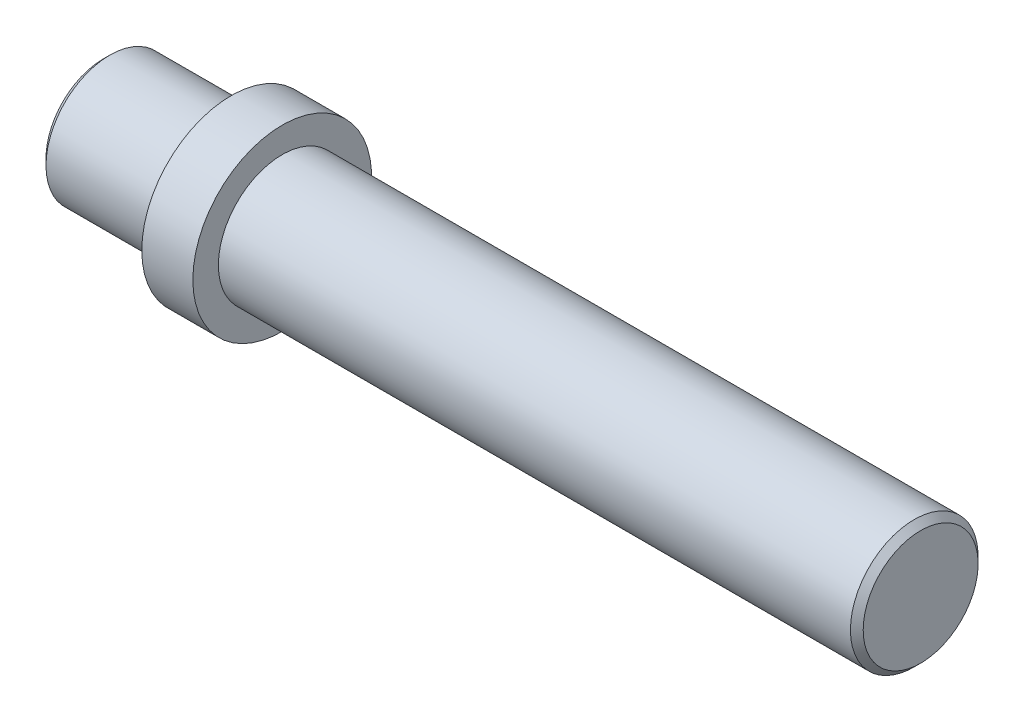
ISO-10303-21;
HEADER;
FILE_DESCRIPTION(('STEP AP214'),'2;1');
FILE_NAME('part.step','',(''),(''),'','','');
FILE_SCHEMA(('AUTOMOTIVE_DESIGN { 1 0 10303 214 1 1 1 1 }'));
ENDSEC;
DATA;
#1=APPLICATION_CONTEXT('core data for automotive mechanical design processes');
#2=APPLICATION_PROTOCOL_DEFINITION('international standard','automotive_design',2000,#1);
#3=PRODUCT_CONTEXT('',#1,'mechanical');
#4=PRODUCT('Part','Part','',(#3));
#5=PRODUCT_RELATED_PRODUCT_CATEGORY('part','',(#4));
#6=PRODUCT_DEFINITION_FORMATION('','',#4);
#7=PRODUCT_DEFINITION_CONTEXT('part definition',#1,'design');
#8=PRODUCT_DEFINITION('design','',#6,#7);
#9=PRODUCT_DEFINITION_SHAPE('','',#8);
#10=(LENGTH_UNIT() NAMED_UNIT(*) SI_UNIT(.MILLI.,.METRE.));
#11=(NAMED_UNIT(*) PLANE_ANGLE_UNIT() SI_UNIT($,.RADIAN.));
#12=(NAMED_UNIT(*) SI_UNIT($,.STERADIAN.) SOLID_ANGLE_UNIT());
#13=UNCERTAINTY_MEASURE_WITH_UNIT(LENGTH_MEASURE(1.E-05),#10,'distance_accuracy_value','');
#14=(GEOMETRIC_REPRESENTATION_CONTEXT(3) GLOBAL_UNCERTAINTY_ASSIGNED_CONTEXT((#13)) GLOBAL_UNIT_ASSIGNED_CONTEXT((#10,
#11,#12)) REPRESENTATION_CONTEXT('',''));
#15=CARTESIAN_POINT('',(0.,0.,0.));
#16=DIRECTION('',(0.,0.,1.));
#17=DIRECTION('',(1.,0.,0.));
#18=AXIS2_PLACEMENT_3D('',#15,#16,#17);
#19=CARTESIAN_POINT('',(0.,0.,0.));
#20=DIRECTION('',(1.,0.,0.));
#21=DIRECTION('',(0.,0.,-1.));
#22=AXIS2_PLACEMENT_3D('',#19,#20,#21);
#23=PLANE('',#22);
#24=CARTESIAN_POINT('',(0.,0.,0.));
#25=DIRECTION('',(1.,0.,0.));
#26=DIRECTION('',(0.,0.,-1.));
#27=AXIS2_PLACEMENT_3D('',#24,#25,#26);
#28=CIRCLE('',#27,4.5);
#29=CARTESIAN_POINT('',(0.,0.,-4.5));
#30=VERTEX_POINT('',#29);
#31=EDGE_CURVE('E30',#30,#30,#28,.F.);
#32=ORIENTED_EDGE('',*,*,#31,.T.);
#33=EDGE_LOOP('',(#32));
#34=FACE_BOUND('',#33,.T.);
#35=ADVANCED_FACE('F24',(#34),#23,.F.);
#36=CARTESIAN_POINT('',(0.,0.,0.));
#37=DIRECTION('',(-1.,0.,0.));
#38=DIRECTION('',(0.,0.,1.));
#39=AXIS2_PLACEMENT_3D('',#36,#37,#38);
#40=CYLINDRICAL_SURFACE('',#39,5.);
#41=CARTESIAN_POINT('',(0.500000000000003,0.,0.));
#42=DIRECTION('',(1.,0.,0.));
#43=DIRECTION('',(0.,0.,-1.));
#44=AXIS2_PLACEMENT_3D('',#41,#42,#43);
#45=CIRCLE('',#44,5.);
#46=CARTESIAN_POINT('',(0.500000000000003,0.,-5.));
#47=VERTEX_POINT('',#46);
#48=EDGE_CURVE('E10',#47,#47,#45,.T.);
#49=ORIENTED_EDGE('',*,*,#48,.T.);
#50=EDGE_LOOP('',(#49));
#51=FACE_BOUND('',#50,.T.);
#52=CARTESIAN_POINT('',(10.,0.,0.));
#53=DIRECTION('',(-1.,0.,0.));
#54=DIRECTION('',(0.,0.,1.));
#55=AXIS2_PLACEMENT_3D('',#52,#53,#54);
#56=CIRCLE('',#55,5.);
#57=CARTESIAN_POINT('',(10.,0.,5.));
#58=VERTEX_POINT('',#57);
#59=EDGE_CURVE('E43',#58,#58,#56,.T.);
#60=ORIENTED_EDGE('',*,*,#59,.T.);
#61=EDGE_LOOP('',(#60));
#62=FACE_BOUND('',#61,.T.);
#63=ADVANCED_FACE('F74',(#51,#62),#40,.T.);
#64=CARTESIAN_POINT('',(10.,5.,0.));
#65=DIRECTION('',(1.,0.,0.));
#66=DIRECTION('',(0.,0.,-1.));
#67=AXIS2_PLACEMENT_3D('',#64,#65,#66);
#68=PLANE('',#67);
#69=ORIENTED_EDGE('',*,*,#59,.F.);
#70=EDGE_LOOP('',(#69));
#71=FACE_BOUND('',#70,.T.);
#72=CARTESIAN_POINT('',(10.,0.,0.));
#73=DIRECTION('',(-1.,0.,0.));
#74=DIRECTION('',(0.,0.,1.));
#75=AXIS2_PLACEMENT_3D('',#72,#73,#74);
#76=CIRCLE('',#75,7.);
#77=CARTESIAN_POINT('',(10.,0.,7.));
#78=VERTEX_POINT('',#77);
#79=EDGE_CURVE('E46',#78,#78,#76,.T.);
#80=ORIENTED_EDGE('',*,*,#79,.T.);
#81=EDGE_LOOP('',(#80));
#82=FACE_BOUND('',#81,.T.);
#83=ADVANCED_FACE('F78',(#71,#82),#68,.F.);
#84=CARTESIAN_POINT('',(0.,0.,0.));
#85=DIRECTION('',(-1.,0.,0.));
#86=DIRECTION('',(0.,0.,1.));
#87=AXIS2_PLACEMENT_3D('',#84,#85,#86);
#88=CYLINDRICAL_SURFACE('',#87,7.);
#89=ORIENTED_EDGE('',*,*,#79,.F.);
#90=EDGE_LOOP('',(#89));
#91=FACE_BOUND('',#90,.T.);
#92=CARTESIAN_POINT('',(14.,0.,0.));
#93=DIRECTION('',(-1.,0.,0.));
#94=DIRECTION('',(0.,0.,1.));
#95=AXIS2_PLACEMENT_3D('',#92,#93,#94);
#96=CIRCLE('',#95,7.);
#97=CARTESIAN_POINT('',(14.,0.,7.));
#98=VERTEX_POINT('',#97);
#99=EDGE_CURVE('E49',#98,#98,#96,.T.);
#100=ORIENTED_EDGE('',*,*,#99,.T.);
#101=EDGE_LOOP('',(#100));
#102=FACE_BOUND('',#101,.T.);
#103=ADVANCED_FACE('F70',(#91,#102),#88,.T.);
#104=CARTESIAN_POINT('',(14.,7.,0.));
#105=DIRECTION('',(-1.,0.,0.));
#106=DIRECTION('',(0.,0.,1.));
#107=AXIS2_PLACEMENT_3D('',#104,#105,#106);
#108=PLANE('',#107);
#109=ORIENTED_EDGE('',*,*,#99,.F.);
#110=EDGE_LOOP('',(#109));
#111=FACE_BOUND('',#110,.T.);
#112=CARTESIAN_POINT('',(14.,0.,0.));
#113=DIRECTION('',(-1.,0.,0.));
#114=DIRECTION('',(0.,0.,1.));
#115=AXIS2_PLACEMENT_3D('',#112,#113,#114);
#116=CIRCLE('',#115,5.);
#117=CARTESIAN_POINT('',(14.,0.,5.));
#118=VERTEX_POINT('',#117);
#119=EDGE_CURVE('E52',#118,#118,#116,.T.);
#120=ORIENTED_EDGE('',*,*,#119,.T.);
#121=EDGE_LOOP('',(#120));
#122=FACE_BOUND('',#121,.T.);
#123=ADVANCED_FACE('F56',(#111,#122),#108,.F.);
#124=CARTESIAN_POINT('',(0.,0.,0.));
#125=DIRECTION('',(-1.,0.,0.));
#126=DIRECTION('',(0.,0.,1.));
#127=AXIS2_PLACEMENT_3D('',#124,#125,#126);
#128=CYLINDRICAL_SURFACE('',#127,5.);
#129=CARTESIAN_POINT('',(63.5,0.,0.));
#130=DIRECTION('',(-1.,0.,0.));
#131=DIRECTION('',(0.,0.,1.));
#132=AXIS2_PLACEMENT_3D('',#129,#130,#131);
#133=CIRCLE('',#132,5.);
#134=CARTESIAN_POINT('',(63.5,0.,5.));
#135=VERTEX_POINT('',#134);
#136=EDGE_CURVE('E38',#135,#135,#133,.T.);
#137=ORIENTED_EDGE('',*,*,#136,.T.);
#138=EDGE_LOOP('',(#137));
#139=FACE_BOUND('',#138,.T.);
#140=ORIENTED_EDGE('',*,*,#119,.F.);
#141=EDGE_LOOP('',(#140));
#142=FACE_BOUND('',#141,.T.);
#143=ADVANCED_FACE('F58',(#139,#142),#128,.T.);
#144=CARTESIAN_POINT('',(64.,5.,0.));
#145=DIRECTION('',(-1.,0.,0.));
#146=DIRECTION('',(0.,0.,1.));
#147=AXIS2_PLACEMENT_3D('',#144,#145,#146);
#148=PLANE('',#147);
#149=CARTESIAN_POINT('',(64.,0.,0.));
#150=DIRECTION('',(-1.,0.,0.));
#151=DIRECTION('',(0.,0.,1.));
#152=AXIS2_PLACEMENT_3D('',#149,#150,#151);
#153=CIRCLE('',#152,4.5);
#154=CARTESIAN_POINT('',(64.,0.,4.5));
#155=VERTEX_POINT('',#154);
#156=EDGE_CURVE('E34',#155,#155,#153,.F.);
#157=ORIENTED_EDGE('',*,*,#156,.T.);
#158=EDGE_LOOP('',(#157));
#159=FACE_BOUND('',#158,.T.);
#160=ADVANCED_FACE('F60',(#159),#148,.F.);
#161=CARTESIAN_POINT('',(63.5,0.,0.));
#162=DIRECTION('',(-1.,0.,0.));
#163=DIRECTION('',(0.,0.,1.));
#164=AXIS2_PLACEMENT_3D('',#161,#162,#163);
#165=CONICAL_SURFACE('',#164,5.,0.785398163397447);
#166=ORIENTED_EDGE('',*,*,#156,.F.);
#167=EDGE_LOOP('',(#166));
#168=FACE_BOUND('',#167,.T.);
#169=ORIENTED_EDGE('',*,*,#136,.F.);
#170=EDGE_LOOP('',(#169));
#171=FACE_BOUND('',#170,.T.);
#172=ADVANCED_FACE('F67',(#168,#171),#165,.T.);
#173=CARTESIAN_POINT('',(0.,0.,0.));
#174=DIRECTION('',(1.,0.,0.));
#175=DIRECTION('',(0.,0.,-1.));
#176=AXIS2_PLACEMENT_3D('',#173,#174,#175);
#177=CONICAL_SURFACE('',#176,4.5,0.785398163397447);
#178=ORIENTED_EDGE('',*,*,#48,.F.);
#179=EDGE_LOOP('',(#178));
#180=FACE_BOUND('',#179,.T.);
#181=ORIENTED_EDGE('',*,*,#31,.F.);
#182=EDGE_LOOP('',(#181));
#183=FACE_BOUND('',#182,.T.);
#184=ADVANCED_FACE('F113',(#180,#183),#177,.T.);
#185=CLOSED_SHELL('',(#35,#63,#83,#103,#123,#143,#160,#172,#184));
#186=MANIFOLD_SOLID_BREP('B2',#185);
#187=ADVANCED_BREP_SHAPE_REPRESENTATION('',(#18,#186),#14);
#188=SHAPE_DEFINITION_REPRESENTATION(#9,#187);
ENDSEC;
END-ISO-10303-21;
